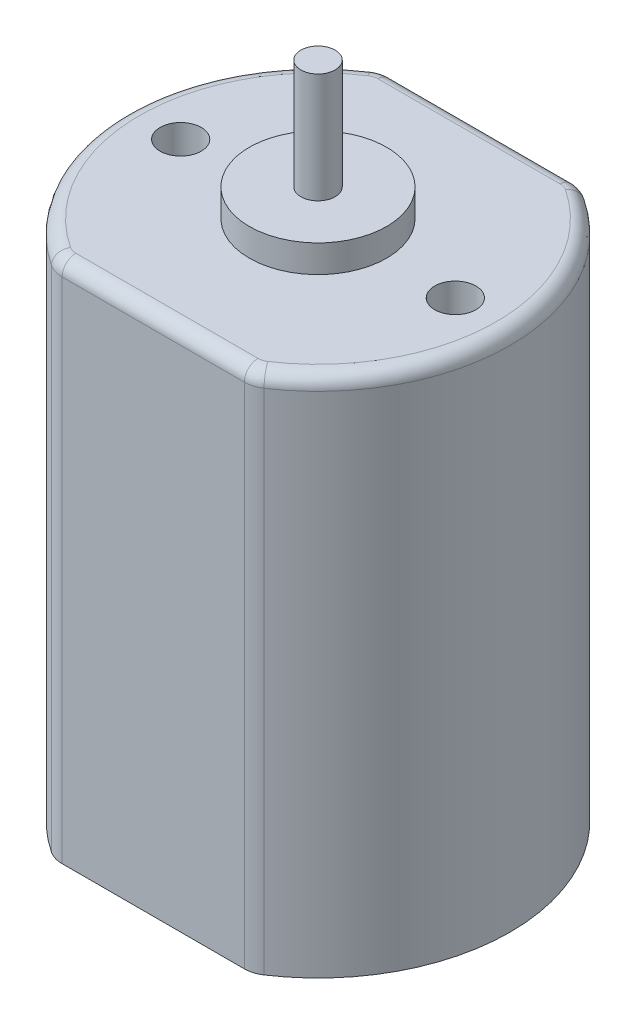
ISO-10303-21;
HEADER;
FILE_DESCRIPTION(('STEP AP214'),'2;1');
FILE_NAME('part.step','',(''),(''),'','','');
FILE_SCHEMA(('AUTOMOTIVE_DESIGN { 1 0 10303 214 1 1 1 1 }'));
ENDSEC;
DATA;
#1=APPLICATION_CONTEXT('core data for automotive mechanical design processes');
#2=APPLICATION_PROTOCOL_DEFINITION('international standard','automotive_design',2000,#1);
#3=PRODUCT_CONTEXT('',#1,'mechanical');
#4=PRODUCT('Part','Part','',(#3));
#5=PRODUCT_RELATED_PRODUCT_CATEGORY('part','',(#4));
#6=PRODUCT_DEFINITION_FORMATION('','',#4);
#7=PRODUCT_DEFINITION_CONTEXT('part definition',#1,'design');
#8=PRODUCT_DEFINITION('design','',#6,#7);
#9=PRODUCT_DEFINITION_SHAPE('','',#8);
#10=(LENGTH_UNIT() NAMED_UNIT(*) SI_UNIT(.MILLI.,.METRE.));
#11=(NAMED_UNIT(*) PLANE_ANGLE_UNIT() SI_UNIT($,.RADIAN.));
#12=(NAMED_UNIT(*) SI_UNIT($,.STERADIAN.) SOLID_ANGLE_UNIT());
#13=UNCERTAINTY_MEASURE_WITH_UNIT(LENGTH_MEASURE(1.E-05),#10,'distance_accuracy_value','');
#14=(GEOMETRIC_REPRESENTATION_CONTEXT(3) GLOBAL_UNCERTAINTY_ASSIGNED_CONTEXT((#13)) GLOBAL_UNIT_ASSIGNED_CONTEXT((#10,
#11,#12)) REPRESENTATION_CONTEXT('',''));
#15=CARTESIAN_POINT('',(0.,0.,0.));
#16=DIRECTION('',(0.,0.,1.));
#17=DIRECTION('',(1.,0.,0.));
#18=AXIS2_PLACEMENT_3D('',#15,#16,#17);
#19=CARTESIAN_POINT('',(0.,20.,0.));
#20=DIRECTION('',(0.,1.,0.));
#21=DIRECTION('',(0.,0.,1.));
#22=AXIS2_PLACEMENT_3D('',#19,#20,#21);
#23=PLANE('',#22);
#24=CARTESIAN_POINT('',(0.,20.,0.));
#25=DIRECTION('',(0.,1.,0.));
#26=DIRECTION('',(0.,0.,1.));
#27=AXIS2_PLACEMENT_3D('',#24,#25,#26);
#28=CIRCLE('',#27,2.5);
#29=CARTESIAN_POINT('',(0.,20.,2.5));
#30=VERTEX_POINT('',#29);
#31=EDGE_CURVE('E273',#30,#30,#28,.T.);
#32=ORIENTED_EDGE('',*,*,#31,.T.);
#33=EDGE_LOOP('',(#32));
#34=FACE_BOUND('',#33,.T.);
#35=CARTESIAN_POINT('',(0.,20.,0.));
#36=DIRECTION('',(0.,1.,0.));
#37=DIRECTION('',(0.,0.,1.));
#38=AXIS2_PLACEMENT_3D('',#35,#36,#37);
#39=CIRCLE('',#38,0.625);
#40=CARTESIAN_POINT('',(0.,20.,0.625));
#41=VERTEX_POINT('',#40);
#42=EDGE_CURVE('E282',#41,#41,#39,.T.);
#43=ORIENTED_EDGE('',*,*,#42,.F.);
#44=EDGE_LOOP('',(#43));
#45=FACE_BOUND('',#44,.T.);
#46=ADVANCED_FACE('F33',(#34,#45),#23,.T.);
#47=CARTESIAN_POINT('',(-3.3166247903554,19.,-5.));
#48=DIRECTION('',(0.,1.,0.));
#49=DIRECTION('',(0.,0.,1.));
#50=AXIS2_PLACEMENT_3D('',#47,#48,#49);
#51=PLANE('',#50);
#52=CARTESIAN_POINT('',(-5.,19.,0.));
#53=DIRECTION('',(0.,1.,0.));
#54=DIRECTION('',(0.,0.,1.));
#55=AXIS2_PLACEMENT_3D('',#52,#53,#54);
#56=CIRCLE('',#55,0.75);
#57=CARTESIAN_POINT('',(-5.,19.,0.75));
#58=VERTEX_POINT('',#57);
#59=EDGE_CURVE('E300',#58,#58,#56,.T.);
#60=ORIENTED_EDGE('',*,*,#59,.F.);
#61=EDGE_LOOP('',(#60));
#62=FACE_BOUND('',#61,.T.);
#63=CARTESIAN_POINT('',(-3.53553390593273,19.,-3.53553390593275));
#64=DIRECTION('',(0.,1.,0.));
#65=DIRECTION('',(0.,0.,1.));
#66=AXIS2_PLACEMENT_3D('',#63,#64,#65);
#67=CIRCLE('',#66,0.5);
#68=CARTESIAN_POINT('',(-3.53553390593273,19.,-3.03553390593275));
#69=VERTEX_POINT('',#68);
#70=EDGE_CURVE('E294',#69,#69,#67,.T.);
#71=ORIENTED_EDGE('',*,*,#70,.F.);
#72=EDGE_LOOP('',(#71));
#73=FACE_BOUND('',#72,.T.);
#74=CARTESIAN_POINT('',(5.,19.,0.));
#75=DIRECTION('',(0.,1.,0.));
#76=DIRECTION('',(0.,0.,1.));
#77=AXIS2_PLACEMENT_3D('',#74,#75,#76);
#78=CIRCLE('',#77,0.75);
#79=CARTESIAN_POINT('',(5.,19.,0.75));
#80=VERTEX_POINT('',#79);
#81=EDGE_CURVE('E288',#80,#80,#78,.T.);
#82=ORIENTED_EDGE('',*,*,#81,.F.);
#83=EDGE_LOOP('',(#82));
#84=FACE_BOUND('',#83,.T.);
#85=DIRECTION('',(1.,0.,0.));
#86=VECTOR('',#85,1.);
#87=CARTESIAN_POINT('',(3.3166247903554,19.,5.5));
#88=LINE('',#87,#86);
#89=CARTESIAN_POINT('',(-3.3166247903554,19.,5.5));
#90=VERTEX_POINT('',#89);
#91=CARTESIAN_POINT('',(3.3166247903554,19.,5.5));
#92=VERTEX_POINT('',#91);
#93=EDGE_CURVE('E191',#90,#92,#88,.T.);
#94=ORIENTED_EDGE('',*,*,#93,.T.);
#95=CARTESIAN_POINT('',(3.3166247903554,19.,5.));
#96=DIRECTION('',(0.,1.,0.));
#97=DIRECTION('',(0.,0.,1.));
#98=AXIS2_PLACEMENT_3D('',#95,#96,#97);
#99=CIRCLE('',#98,0.5);
#100=CARTESIAN_POINT('',(3.59301018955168,19.,5.41666666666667));
#101=VERTEX_POINT('',#100);
#102=EDGE_CURVE('E193',#92,#101,#99,.T.);
#103=ORIENTED_EDGE('',*,*,#102,.T.);
#104=CARTESIAN_POINT('',(0.,19.,0.));
#105=DIRECTION('',(0.,1.,0.));
#106=DIRECTION('',(0.,0.,1.));
#107=AXIS2_PLACEMENT_3D('',#104,#105,#106);
#108=CIRCLE('',#107,6.5);
#109=CARTESIAN_POINT('',(3.59301018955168,19.,-5.41666666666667));
#110=VERTEX_POINT('',#109);
#111=EDGE_CURVE('E132',#101,#110,#108,.T.);
#112=ORIENTED_EDGE('',*,*,#111,.T.);
#113=CARTESIAN_POINT('',(3.31662479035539,19.,-5.));
#114=DIRECTION('',(0.,1.,0.));
#115=DIRECTION('',(0.,0.,1.));
#116=AXIS2_PLACEMENT_3D('',#113,#114,#115);
#117=CIRCLE('',#116,0.5);
#118=CARTESIAN_POINT('',(3.31662479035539,19.,-5.5));
#119=VERTEX_POINT('',#118);
#120=EDGE_CURVE('E181',#110,#119,#117,.T.);
#121=ORIENTED_EDGE('',*,*,#120,.T.);
#122=DIRECTION('',(-1.,0.,0.));
#123=VECTOR('',#122,1.);
#124=CARTESIAN_POINT('',(-3.3166247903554,19.,-5.5));
#125=LINE('',#124,#123);
#126=CARTESIAN_POINT('',(-3.3166247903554,19.,-5.5));
#127=VERTEX_POINT('',#126);
#128=EDGE_CURVE('E183',#119,#127,#125,.T.);
#129=ORIENTED_EDGE('',*,*,#128,.T.);
#130=CARTESIAN_POINT('',(-3.3166247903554,19.,-5.));
#131=DIRECTION('',(0.,1.,0.));
#132=DIRECTION('',(0.,0.,1.));
#133=AXIS2_PLACEMENT_3D('',#130,#131,#132);
#134=CIRCLE('',#133,0.5);
#135=CARTESIAN_POINT('',(-3.59301018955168,19.,-5.41666666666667));
#136=VERTEX_POINT('',#135);
#137=EDGE_CURVE('E185',#127,#136,#134,.T.);
#138=ORIENTED_EDGE('',*,*,#137,.T.);
#139=CARTESIAN_POINT('',(0.,19.,0.));
#140=DIRECTION('',(0.,1.,0.));
#141=DIRECTION('',(0.,0.,1.));
#142=AXIS2_PLACEMENT_3D('',#139,#140,#141);
#143=CIRCLE('',#142,6.5);
#144=CARTESIAN_POINT('',(-3.59301018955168,19.,5.41666666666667));
#145=VERTEX_POINT('',#144);
#146=EDGE_CURVE('E187',#136,#145,#143,.T.);
#147=ORIENTED_EDGE('',*,*,#146,.T.);
#148=CARTESIAN_POINT('',(-3.3166247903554,19.,5.));
#149=DIRECTION('',(0.,1.,0.));
#150=DIRECTION('',(0.,0.,1.));
#151=AXIS2_PLACEMENT_3D('',#148,#149,#150);
#152=CIRCLE('',#151,0.5);
#153=EDGE_CURVE('E189',#145,#90,#152,.T.);
#154=ORIENTED_EDGE('',*,*,#153,.T.);
#155=EDGE_LOOP('',(#94,#103,#112,#121,#129,#138,#147,#154));
#156=FACE_BOUND('',#155,.T.);
#157=CARTESIAN_POINT('',(0.,19.,0.));
#158=DIRECTION('',(0.,1.,0.));
#159=DIRECTION('',(0.,0.,1.));
#160=AXIS2_PLACEMENT_3D('',#157,#158,#159);
#161=CIRCLE('',#160,2.5);
#162=CARTESIAN_POINT('',(0.,19.,2.5));
#163=VERTEX_POINT('',#162);
#164=EDGE_CURVE('E276',#163,#163,#161,.T.);
#165=ORIENTED_EDGE('',*,*,#164,.F.);
#166=EDGE_LOOP('',(#165));
#167=FACE_BOUND('',#166,.T.);
#168=ADVANCED_FACE('F306',(#62,#73,#84,#156,#167),#51,.T.);
#169=CARTESIAN_POINT('',(-3.3166247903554,19.,-5.));
#170=DIRECTION('',(0.,-1.,0.));
#171=DIRECTION('',(0.,0.,-1.));
#172=AXIS2_PLACEMENT_3D('',#169,#170,#171);
#173=CYLINDRICAL_SURFACE('',#172,1.);
#174=DIRECTION('',(0.,-1.,0.));
#175=VECTOR('',#174,1.);
#176=CARTESIAN_POINT('',(-3.86939558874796,19.,-5.83333333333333));
#177=LINE('',#176,#175);
#178=CARTESIAN_POINT('',(-3.86939558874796,18.5,-5.83333333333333));
#179=VERTEX_POINT('',#178);
#180=CARTESIAN_POINT('',(-3.86939558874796,0.,-5.83333333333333));
#181=VERTEX_POINT('',#180);
#182=EDGE_CURVE('E121',#179,#181,#177,.T.);
#183=ORIENTED_EDGE('',*,*,#182,.F.);
#184=CARTESIAN_POINT('',(-3.3166247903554,18.5,-5.));
#185=DIRECTION('',(0.,1.,0.));
#186=DIRECTION('',(0.,0.,1.));
#187=AXIS2_PLACEMENT_3D('',#184,#185,#186);
#188=CIRCLE('',#187,1.);
#189=CARTESIAN_POINT('',(-3.3166247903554,18.5,-6.));
#190=VERTEX_POINT('',#189);
#191=EDGE_CURVE('E204',#179,#190,#188,.F.);
#192=ORIENTED_EDGE('',*,*,#191,.T.);
#193=DIRECTION('',(0.,-1.,0.));
#194=VECTOR('',#193,1.);
#195=CARTESIAN_POINT('',(-3.3166247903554,19.,-6.));
#196=LINE('',#195,#194);
#197=CARTESIAN_POINT('',(-3.3166247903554,0.,-6.));
#198=VERTEX_POINT('',#197);
#199=EDGE_CURVE('E144',#190,#198,#196,.T.);
#200=ORIENTED_EDGE('',*,*,#199,.T.);
#201=CARTESIAN_POINT('',(-3.3166247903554,0.,-5.));
#202=DIRECTION('',(0.,1.,0.));
#203=DIRECTION('',(0.,0.,1.));
#204=AXIS2_PLACEMENT_3D('',#201,#202,#203);
#205=CIRCLE('',#204,1.);
#206=EDGE_CURVE('E139',#198,#181,#205,.T.);
#207=ORIENTED_EDGE('',*,*,#206,.T.);
#208=EDGE_LOOP('',(#183,#192,#200,#207));
#209=FACE_BOUND('',#208,.T.);
#210=ADVANCED_FACE('F35',(#209),#173,.T.);
#211=CARTESIAN_POINT('',(0.,19.,0.));
#212=DIRECTION('',(0.,-1.,0.));
#213=DIRECTION('',(0.,0.,-1.));
#214=AXIS2_PLACEMENT_3D('',#211,#212,#213);
#215=CYLINDRICAL_SURFACE('',#214,7.);
#216=DIRECTION('',(0.,-1.,0.));
#217=VECTOR('',#216,1.);
#218=CARTESIAN_POINT('',(-3.86939558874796,19.,5.83333333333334));
#219=LINE('',#218,#217);
#220=CARTESIAN_POINT('',(-3.86939558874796,18.5,5.83333333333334));
#221=VERTEX_POINT('',#220);
#222=CARTESIAN_POINT('',(-3.86939558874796,0.,5.83333333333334));
#223=VERTEX_POINT('',#222);
#224=EDGE_CURVE('E133',#221,#223,#219,.T.);
#225=ORIENTED_EDGE('',*,*,#224,.F.);
#226=CARTESIAN_POINT('',(0.,18.5,0.));
#227=DIRECTION('',(0.,1.,0.));
#228=DIRECTION('',(0.,0.,1.));
#229=AXIS2_PLACEMENT_3D('',#226,#227,#228);
#230=CIRCLE('',#229,7.);
#231=EDGE_CURVE('E128',#221,#179,#230,.F.);
#232=ORIENTED_EDGE('',*,*,#231,.T.);
#233=ORIENTED_EDGE('',*,*,#182,.T.);
#234=CARTESIAN_POINT('',(0.,0.,0.));
#235=DIRECTION('',(0.,1.,0.));
#236=DIRECTION('',(0.,0.,1.));
#237=AXIS2_PLACEMENT_3D('',#234,#235,#236);
#238=CIRCLE('',#237,7.);
#239=EDGE_CURVE('E125',#181,#223,#238,.T.);
#240=ORIENTED_EDGE('',*,*,#239,.T.);
#241=EDGE_LOOP('',(#225,#232,#233,#240));
#242=FACE_BOUND('',#241,.T.);
#243=ADVANCED_FACE('F124',(#242),#215,.T.);
#244=CARTESIAN_POINT('',(-3.3166247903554,19.,5.));
#245=DIRECTION('',(0.,-1.,0.));
#246=DIRECTION('',(0.,0.,-1.));
#247=AXIS2_PLACEMENT_3D('',#244,#245,#246);
#248=CYLINDRICAL_SURFACE('',#247,1.);
#249=DIRECTION('',(0.,-1.,0.));
#250=VECTOR('',#249,1.);
#251=CARTESIAN_POINT('',(-3.3166247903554,19.,6.));
#252=LINE('',#251,#250);
#253=CARTESIAN_POINT('',(-3.3166247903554,18.5,6.));
#254=VERTEX_POINT('',#253);
#255=CARTESIAN_POINT('',(-3.3166247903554,0.,6.));
#256=VERTEX_POINT('',#255);
#257=EDGE_CURVE('E177',#254,#256,#252,.T.);
#258=ORIENTED_EDGE('',*,*,#257,.F.);
#259=CARTESIAN_POINT('',(-3.3166247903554,18.5,5.));
#260=DIRECTION('',(0.,1.,0.));
#261=DIRECTION('',(0.,0.,1.));
#262=AXIS2_PLACEMENT_3D('',#259,#260,#261);
#263=CIRCLE('',#262,1.);
#264=EDGE_CURVE('E201',#254,#221,#263,.F.);
#265=ORIENTED_EDGE('',*,*,#264,.T.);
#266=ORIENTED_EDGE('',*,*,#224,.T.);
#267=CARTESIAN_POINT('',(-3.3166247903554,0.,5.));
#268=DIRECTION('',(0.,1.,0.));
#269=DIRECTION('',(0.,0.,-1.));
#270=AXIS2_PLACEMENT_3D('',#267,#268,#269);
#271=CIRCLE('',#270,1.);
#272=EDGE_CURVE('E142',#223,#256,#271,.T.);
#273=ORIENTED_EDGE('',*,*,#272,.T.);
#274=EDGE_LOOP('',(#258,#265,#266,#273));
#275=FACE_BOUND('',#274,.T.);
#276=ADVANCED_FACE('F261',(#275),#248,.T.);
#277=CARTESIAN_POINT('',(-3.3166247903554,19.,6.));
#278=DIRECTION('',(0.,0.,-1.));
#279=DIRECTION('',(-1.,0.,0.));
#280=AXIS2_PLACEMENT_3D('',#277,#278,#279);
#281=PLANE('',#280);
#282=DIRECTION('',(0.,-1.,0.));
#283=VECTOR('',#282,1.);
#284=CARTESIAN_POINT('',(3.3166247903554,19.,6.));
#285=LINE('',#284,#283);
#286=CARTESIAN_POINT('',(3.3166247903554,18.5,6.));
#287=VERTEX_POINT('',#286);
#288=CARTESIAN_POINT('',(3.3166247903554,0.,6.));
#289=VERTEX_POINT('',#288);
#290=EDGE_CURVE('E175',#287,#289,#285,.T.);
#291=ORIENTED_EDGE('',*,*,#290,.F.);
#292=DIRECTION('',(1.,0.,0.));
#293=VECTOR('',#292,1.);
#294=CARTESIAN_POINT('',(-3.3166247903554,18.5,6.));
#295=LINE('',#294,#293);
#296=EDGE_CURVE('E199',#287,#254,#295,.F.);
#297=ORIENTED_EDGE('',*,*,#296,.T.);
#298=ORIENTED_EDGE('',*,*,#257,.T.);
#299=DIRECTION('',(1.,0.,0.));
#300=VECTOR('',#299,1.);
#301=CARTESIAN_POINT('',(-3.3166247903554,0.,6.));
#302=LINE('',#301,#300);
#303=EDGE_CURVE('E154',#256,#289,#302,.T.);
#304=ORIENTED_EDGE('',*,*,#303,.T.);
#305=EDGE_LOOP('',(#291,#297,#298,#304));
#306=FACE_BOUND('',#305,.T.);
#307=ADVANCED_FACE('F258',(#306),#281,.F.);
#308=CARTESIAN_POINT('',(3.3166247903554,19.,5.));
#309=DIRECTION('',(0.,-1.,0.));
#310=DIRECTION('',(0.,0.,-1.));
#311=AXIS2_PLACEMENT_3D('',#308,#309,#310);
#312=CYLINDRICAL_SURFACE('',#311,1.);
#313=DIRECTION('',(0.,-1.,0.));
#314=VECTOR('',#313,1.);
#315=CARTESIAN_POINT('',(3.86939558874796,19.,5.83333333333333));
#316=LINE('',#315,#314);
#317=CARTESIAN_POINT('',(3.86939558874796,18.5,5.83333333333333));
#318=VERTEX_POINT('',#317);
#319=CARTESIAN_POINT('',(3.86939558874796,0.,5.83333333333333));
#320=VERTEX_POINT('',#319);
#321=EDGE_CURVE('E173',#318,#320,#316,.T.);
#322=ORIENTED_EDGE('',*,*,#321,.F.);
#323=CARTESIAN_POINT('',(3.3166247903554,18.5,5.));
#324=DIRECTION('',(0.,1.,0.));
#325=DIRECTION('',(0.,0.,1.));
#326=AXIS2_PLACEMENT_3D('',#323,#324,#325);
#327=CIRCLE('',#326,1.);
#328=EDGE_CURVE('E196',#318,#287,#327,.F.);
#329=ORIENTED_EDGE('',*,*,#328,.T.);
#330=ORIENTED_EDGE('',*,*,#290,.T.);
#331=CARTESIAN_POINT('',(3.3166247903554,0.,5.));
#332=DIRECTION('',(0.,1.,0.));
#333=DIRECTION('',(0.,0.,-1.));
#334=AXIS2_PLACEMENT_3D('',#331,#332,#333);
#335=CIRCLE('',#334,1.);
#336=EDGE_CURVE('E157',#289,#320,#335,.T.);
#337=ORIENTED_EDGE('',*,*,#336,.T.);
#338=EDGE_LOOP('',(#322,#329,#330,#337));
#339=FACE_BOUND('',#338,.T.);
#340=ADVANCED_FACE('F241',(#339),#312,.T.);
#341=CARTESIAN_POINT('',(0.,19.,0.));
#342=DIRECTION('',(0.,-1.,0.));
#343=DIRECTION('',(0.,0.,-1.));
#344=AXIS2_PLACEMENT_3D('',#341,#342,#343);
#345=CYLINDRICAL_SURFACE('',#344,7.);
#346=DIRECTION('',(0.,-1.,0.));
#347=VECTOR('',#346,1.);
#348=CARTESIAN_POINT('',(3.86939558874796,19.,-5.83333333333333));
#349=LINE('',#348,#347);
#350=CARTESIAN_POINT('',(3.86939558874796,18.5,-5.83333333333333));
#351=VERTEX_POINT('',#350);
#352=CARTESIAN_POINT('',(3.86939558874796,0.,-5.83333333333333));
#353=VERTEX_POINT('',#352);
#354=EDGE_CURVE('E171',#351,#353,#349,.T.);
#355=ORIENTED_EDGE('',*,*,#354,.F.);
#356=CARTESIAN_POINT('',(0.,18.5,0.));
#357=DIRECTION('',(0.,1.,0.));
#358=DIRECTION('',(0.,0.,1.));
#359=AXIS2_PLACEMENT_3D('',#356,#357,#358);
#360=CIRCLE('',#359,7.);
#361=EDGE_CURVE('E11',#351,#318,#360,.F.);
#362=ORIENTED_EDGE('',*,*,#361,.T.);
#363=ORIENTED_EDGE('',*,*,#321,.T.);
#364=CARTESIAN_POINT('',(0.,0.,0.));
#365=DIRECTION('',(0.,1.,0.));
#366=DIRECTION('',(0.,0.,1.));
#367=AXIS2_PLACEMENT_3D('',#364,#365,#366);
#368=CIRCLE('',#367,7.);
#369=EDGE_CURVE('E160',#320,#353,#368,.T.);
#370=ORIENTED_EDGE('',*,*,#369,.T.);
#371=EDGE_LOOP('',(#355,#362,#363,#370));
#372=FACE_BOUND('',#371,.T.);
#373=ADVANCED_FACE('F238',(#372),#345,.T.);
#374=CARTESIAN_POINT('',(3.31662479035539,19.,-5.));
#375=DIRECTION('',(0.,-1.,0.));
#376=DIRECTION('',(0.,0.,-1.));
#377=AXIS2_PLACEMENT_3D('',#374,#375,#376);
#378=CYLINDRICAL_SURFACE('',#377,1.);
#379=DIRECTION('',(0.,-1.,0.));
#380=VECTOR('',#379,1.);
#381=CARTESIAN_POINT('',(3.31662479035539,19.,-6.));
#382=LINE('',#381,#380);
#383=CARTESIAN_POINT('',(3.31662479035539,18.5,-6.));
#384=VERTEX_POINT('',#383);
#385=CARTESIAN_POINT('',(3.31662479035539,0.,-6.));
#386=VERTEX_POINT('',#385);
#387=EDGE_CURVE('E169',#384,#386,#382,.T.);
#388=ORIENTED_EDGE('',*,*,#387,.F.);
#389=CARTESIAN_POINT('',(3.31662479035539,18.5,-5.));
#390=DIRECTION('',(0.,1.,0.));
#391=DIRECTION('',(0.,0.,1.));
#392=AXIS2_PLACEMENT_3D('',#389,#390,#391);
#393=CIRCLE('',#392,1.);
#394=EDGE_CURVE('E41',#384,#351,#393,.F.);
#395=ORIENTED_EDGE('',*,*,#394,.T.);
#396=ORIENTED_EDGE('',*,*,#354,.T.);
#397=CARTESIAN_POINT('',(3.31662479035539,0.,-5.));
#398=DIRECTION('',(0.,1.,0.));
#399=DIRECTION('',(0.,0.,1.));
#400=AXIS2_PLACEMENT_3D('',#397,#398,#399);
#401=CIRCLE('',#400,1.);
#402=EDGE_CURVE('E163',#353,#386,#401,.T.);
#403=ORIENTED_EDGE('',*,*,#402,.T.);
#404=EDGE_LOOP('',(#388,#395,#396,#403));
#405=FACE_BOUND('',#404,.T.);
#406=ADVANCED_FACE('F478',(#405),#378,.T.);
#407=CARTESIAN_POINT('',(-3.3166247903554,19.,-6.));
#408=DIRECTION('',(0.,0.,1.));
#409=DIRECTION('',(1.,0.,0.));
#410=AXIS2_PLACEMENT_3D('',#407,#408,#409);
#411=PLANE('',#410);
#412=ORIENTED_EDGE('',*,*,#199,.F.);
#413=DIRECTION('',(-1.,0.,0.));
#414=VECTOR('',#413,1.);
#415=CARTESIAN_POINT('',(3.31662479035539,18.5,-6.));
#416=LINE('',#415,#414);
#417=EDGE_CURVE('E55',#190,#384,#416,.F.);
#418=ORIENTED_EDGE('',*,*,#417,.T.);
#419=ORIENTED_EDGE('',*,*,#387,.T.);
#420=DIRECTION('',(-1.,0.,0.));
#421=VECTOR('',#420,1.);
#422=CARTESIAN_POINT('',(-3.3166247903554,0.,-6.));
#423=LINE('',#422,#421);
#424=EDGE_CURVE('E166',#386,#198,#423,.T.);
#425=ORIENTED_EDGE('',*,*,#424,.T.);
#426=EDGE_LOOP('',(#412,#418,#419,#425));
#427=FACE_BOUND('',#426,.T.);
#428=ADVANCED_FACE('F209',(#427),#411,.F.);
#429=CARTESIAN_POINT('',(-3.3166247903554,0.,-5.));
#430=DIRECTION('',(0.,1.,0.));
#431=DIRECTION('',(0.,0.,1.));
#432=AXIS2_PLACEMENT_3D('',#429,#430,#431);
#433=PLANE('',#432);
#434=ORIENTED_EDGE('',*,*,#206,.F.);
#435=ORIENTED_EDGE('',*,*,#424,.F.);
#436=ORIENTED_EDGE('',*,*,#402,.F.);
#437=ORIENTED_EDGE('',*,*,#369,.F.);
#438=ORIENTED_EDGE('',*,*,#336,.F.);
#439=ORIENTED_EDGE('',*,*,#303,.F.);
#440=ORIENTED_EDGE('',*,*,#272,.F.);
#441=ORIENTED_EDGE('',*,*,#239,.F.);
#442=EDGE_LOOP('',(#434,#435,#436,#437,#438,#439,#440,#441));
#443=FACE_BOUND('',#442,.T.);
#444=ADVANCED_FACE('F137',(#443),#433,.F.);
#445=CARTESIAN_POINT('',(-3.3166247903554,18.5,-5.));
#446=DIRECTION('',(0.,1.,0.));
#447=DIRECTION('',(0.,0.,1.));
#448=AXIS2_PLACEMENT_3D('',#445,#446,#447);
#449=DEGENERATE_TOROIDAL_SURFACE('',#448,0.5,0.5,.T.);
#450=CARTESIAN_POINT('',(-3.3166247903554,18.5,-5.5));
#451=DIRECTION('',(1.,0.,0.));
#452=DIRECTION('',(0.,0.,-1.));
#453=AXIS2_PLACEMENT_3D('',#450,#451,#452);
#454=CIRCLE('',#453,0.5);
#455=EDGE_CURVE('E149',#190,#127,#454,.T.);
#456=ORIENTED_EDGE('',*,*,#455,.F.);
#457=ORIENTED_EDGE('',*,*,#191,.F.);
#458=CARTESIAN_POINT('',(-3.59301018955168,18.5,-5.41666666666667));
#459=DIRECTION('',(-0.833333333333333,0.,0.552770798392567));
#460=DIRECTION('',(0.552770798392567,0.,0.833333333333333));
#461=AXIS2_PLACEMENT_3D('',#458,#459,#460);
#462=CIRCLE('',#461,0.5);
#463=EDGE_CURVE('E146',#136,#179,#462,.T.);
#464=ORIENTED_EDGE('',*,*,#463,.F.);
#465=ORIENTED_EDGE('',*,*,#137,.F.);
#466=EDGE_LOOP('',(#456,#457,#464,#465));
#467=FACE_BOUND('',#466,.T.);
#468=ADVANCED_FACE('F212',(#467),#449,.T.);
#469=CARTESIAN_POINT('',(0.,18.5,0.));
#470=DIRECTION('',(0.,1.,0.));
#471=DIRECTION('',(0.,0.,1.));
#472=AXIS2_PLACEMENT_3D('',#469,#470,#471);
#473=TOROIDAL_SURFACE('',#472,6.5,0.5);
#474=ORIENTED_EDGE('',*,*,#463,.T.);
#475=ORIENTED_EDGE('',*,*,#231,.F.);
#476=CARTESIAN_POINT('',(-3.59301018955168,18.5,5.41666666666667));
#477=DIRECTION('',(0.833333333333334,0.,0.552770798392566));
#478=DIRECTION('',(0.552770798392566,0.,-0.833333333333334));
#479=AXIS2_PLACEMENT_3D('',#476,#477,#478);
#480=CIRCLE('',#479,0.5);
#481=EDGE_CURVE('E215',#145,#221,#480,.T.);
#482=ORIENTED_EDGE('',*,*,#481,.F.);
#483=ORIENTED_EDGE('',*,*,#146,.F.);
#484=EDGE_LOOP('',(#474,#475,#482,#483));
#485=FACE_BOUND('',#484,.T.);
#486=ADVANCED_FACE('F451',(#485),#473,.T.);
#487=CARTESIAN_POINT('',(-3.3166247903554,18.5,-5.5));
#488=DIRECTION('',(1.,0.,0.));
#489=DIRECTION('',(0.,0.,-1.));
#490=AXIS2_PLACEMENT_3D('',#487,#488,#489);
#491=CYLINDRICAL_SURFACE('',#490,0.5);
#492=ORIENTED_EDGE('',*,*,#455,.T.);
#493=ORIENTED_EDGE('',*,*,#128,.F.);
#494=CARTESIAN_POINT('',(3.31662479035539,18.5,-5.5));
#495=DIRECTION('',(1.,0.,0.));
#496=DIRECTION('',(0.,0.,-1.));
#497=AXIS2_PLACEMENT_3D('',#494,#495,#496);
#498=CIRCLE('',#497,0.5);
#499=EDGE_CURVE('E219',#384,#119,#498,.T.);
#500=ORIENTED_EDGE('',*,*,#499,.F.);
#501=ORIENTED_EDGE('',*,*,#417,.F.);
#502=EDGE_LOOP('',(#492,#493,#500,#501));
#503=FACE_BOUND('',#502,.T.);
#504=ADVANCED_FACE('F217',(#503),#491,.T.);
#505=CARTESIAN_POINT('',(-3.3166247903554,18.5,5.));
#506=DIRECTION('',(0.,1.,0.));
#507=DIRECTION('',(0.,0.,1.));
#508=AXIS2_PLACEMENT_3D('',#505,#506,#507);
#509=DEGENERATE_TOROIDAL_SURFACE('',#508,0.5,0.5,.T.);
#510=ORIENTED_EDGE('',*,*,#481,.T.);
#511=ORIENTED_EDGE('',*,*,#264,.F.);
#512=CARTESIAN_POINT('',(-3.3166247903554,18.5,5.5));
#513=DIRECTION('',(1.,0.,0.));
#514=DIRECTION('',(0.,0.,-1.));
#515=AXIS2_PLACEMENT_3D('',#512,#513,#514);
#516=CIRCLE('',#515,0.5);
#517=EDGE_CURVE('E222',#90,#254,#516,.T.);
#518=ORIENTED_EDGE('',*,*,#517,.F.);
#519=ORIENTED_EDGE('',*,*,#153,.F.);
#520=EDGE_LOOP('',(#510,#511,#518,#519));
#521=FACE_BOUND('',#520,.T.);
#522=ADVANCED_FACE('F264',(#521),#509,.T.);
#523=CARTESIAN_POINT('',(3.31662479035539,18.5,-5.));
#524=DIRECTION('',(0.,1.,0.));
#525=DIRECTION('',(0.,0.,1.));
#526=AXIS2_PLACEMENT_3D('',#523,#524,#525);
#527=DEGENERATE_TOROIDAL_SURFACE('',#526,0.5,0.5,.T.);
#528=ORIENTED_EDGE('',*,*,#499,.T.);
#529=ORIENTED_EDGE('',*,*,#120,.F.);
#530=CARTESIAN_POINT('',(3.59301018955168,18.5,-5.41666666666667));
#531=DIRECTION('',(0.833333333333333,0.,0.552770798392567));
#532=DIRECTION('',(0.552770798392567,0.,-0.833333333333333));
#533=AXIS2_PLACEMENT_3D('',#530,#531,#532);
#534=CIRCLE('',#533,0.5);
#535=EDGE_CURVE('E227',#351,#110,#534,.T.);
#536=ORIENTED_EDGE('',*,*,#535,.F.);
#537=ORIENTED_EDGE('',*,*,#394,.F.);
#538=EDGE_LOOP('',(#528,#529,#536,#537));
#539=FACE_BOUND('',#538,.T.);
#540=ADVANCED_FACE('F225',(#539),#527,.T.);
#541=CARTESIAN_POINT('',(-3.3166247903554,18.5,5.5));
#542=DIRECTION('',(-1.,0.,0.));
#543=DIRECTION('',(0.,0.,1.));
#544=AXIS2_PLACEMENT_3D('',#541,#542,#543);
#545=CYLINDRICAL_SURFACE('',#544,0.5);
#546=ORIENTED_EDGE('',*,*,#517,.T.);
#547=ORIENTED_EDGE('',*,*,#296,.F.);
#548=CARTESIAN_POINT('',(3.3166247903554,18.5,5.5));
#549=DIRECTION('',(1.,0.,0.));
#550=DIRECTION('',(0.,0.,-1.));
#551=AXIS2_PLACEMENT_3D('',#548,#549,#550);
#552=CIRCLE('',#551,0.5);
#553=EDGE_CURVE('E231',#92,#287,#552,.T.);
#554=ORIENTED_EDGE('',*,*,#553,.F.);
#555=ORIENTED_EDGE('',*,*,#93,.F.);
#556=EDGE_LOOP('',(#546,#547,#554,#555));
#557=FACE_BOUND('',#556,.T.);
#558=ADVANCED_FACE('F254',(#557),#545,.T.);
#559=CARTESIAN_POINT('',(0.,18.5,0.));
#560=DIRECTION('',(0.,1.,0.));
#561=DIRECTION('',(0.,0.,1.));
#562=AXIS2_PLACEMENT_3D('',#559,#560,#561);
#563=TOROIDAL_SURFACE('',#562,6.5,0.5);
#564=ORIENTED_EDGE('',*,*,#535,.T.);
#565=ORIENTED_EDGE('',*,*,#111,.F.);
#566=CARTESIAN_POINT('',(3.59301018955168,18.5,5.41666666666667));
#567=DIRECTION('',(-0.833333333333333,0.,0.552770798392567));
#568=DIRECTION('',(0.552770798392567,0.,0.833333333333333));
#569=AXIS2_PLACEMENT_3D('',#566,#567,#568);
#570=CIRCLE('',#569,0.5);
#571=EDGE_CURVE('E235',#318,#101,#570,.T.);
#572=ORIENTED_EDGE('',*,*,#571,.F.);
#573=ORIENTED_EDGE('',*,*,#361,.F.);
#574=EDGE_LOOP('',(#564,#565,#572,#573));
#575=FACE_BOUND('',#574,.T.);
#576=ADVANCED_FACE('F234',(#575),#563,.T.);
#577=CARTESIAN_POINT('',(3.3166247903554,18.5,5.));
#578=DIRECTION('',(0.,1.,0.));
#579=DIRECTION('',(0.,0.,1.));
#580=AXIS2_PLACEMENT_3D('',#577,#578,#579);
#581=DEGENERATE_TOROIDAL_SURFACE('',#580,0.5,0.5,.T.);
#582=ORIENTED_EDGE('',*,*,#553,.T.);
#583=ORIENTED_EDGE('',*,*,#328,.F.);
#584=ORIENTED_EDGE('',*,*,#571,.T.);
#585=ORIENTED_EDGE('',*,*,#102,.F.);
#586=EDGE_LOOP('',(#582,#583,#584,#585));
#587=FACE_BOUND('',#586,.T.);
#588=ADVANCED_FACE('F246',(#587),#581,.T.);
#589=CARTESIAN_POINT('',(0.,20.,0.));
#590=DIRECTION('',(0.,-1.,0.));
#591=DIRECTION('',(0.,0.,-1.));
#592=AXIS2_PLACEMENT_3D('',#589,#590,#591);
#593=CYLINDRICAL_SURFACE('',#592,2.5);
#594=ORIENTED_EDGE('',*,*,#31,.F.);
#595=EDGE_LOOP('',(#594));
#596=FACE_BOUND('',#595,.T.);
#597=ORIENTED_EDGE('',*,*,#164,.T.);
#598=EDGE_LOOP('',(#597));
#599=FACE_BOUND('',#598,.T.);
#600=ADVANCED_FACE('F317',(#596,#599),#593,.T.);
#601=CARTESIAN_POINT('',(0.,24.,0.));
#602=DIRECTION('',(0.,-1.,0.));
#603=DIRECTION('',(0.,0.,-1.));
#604=AXIS2_PLACEMENT_3D('',#601,#602,#603);
#605=CYLINDRICAL_SURFACE('',#604,0.625);
#606=CARTESIAN_POINT('',(0.,24.,0.));
#607=DIRECTION('',(0.,1.,0.));
#608=DIRECTION('',(0.,0.,1.));
#609=AXIS2_PLACEMENT_3D('',#606,#607,#608);
#610=CIRCLE('',#609,0.625);
#611=CARTESIAN_POINT('',(0.,24.,0.625));
#612=VERTEX_POINT('',#611);
#613=EDGE_CURVE('E279',#612,#612,#610,.T.);
#614=ORIENTED_EDGE('',*,*,#613,.F.);
#615=EDGE_LOOP('',(#614));
#616=FACE_BOUND('',#615,.T.);
#617=ORIENTED_EDGE('',*,*,#42,.T.);
#618=EDGE_LOOP('',(#617));
#619=FACE_BOUND('',#618,.T.);
#620=ADVANCED_FACE('F319',(#616,#619),#605,.T.);
#621=CARTESIAN_POINT('',(0.,24.,0.));
#622=DIRECTION('',(0.,1.,0.));
#623=DIRECTION('',(0.,0.,1.));
#624=AXIS2_PLACEMENT_3D('',#621,#622,#623);
#625=PLANE('',#624);
#626=ORIENTED_EDGE('',*,*,#613,.T.);
#627=EDGE_LOOP('',(#626));
#628=FACE_BOUND('',#627,.T.);
#629=ADVANCED_FACE('F326',(#628),#625,.T.);
#630=CARTESIAN_POINT('',(5.,17.,0.));
#631=DIRECTION('',(0.,1.,0.));
#632=DIRECTION('',(0.,0.,1.));
#633=AXIS2_PLACEMENT_3D('',#630,#631,#632);
#634=CYLINDRICAL_SURFACE('',#633,0.75);
#635=CARTESIAN_POINT('',(5.,17.,0.));
#636=DIRECTION('',(0.,1.,0.));
#637=DIRECTION('',(0.,0.,1.));
#638=AXIS2_PLACEMENT_3D('',#635,#636,#637);
#639=CIRCLE('',#638,0.75);
#640=CARTESIAN_POINT('',(5.,17.,0.75));
#641=VERTEX_POINT('',#640);
#642=EDGE_CURVE('E285',#641,#641,#639,.T.);
#643=ORIENTED_EDGE('',*,*,#642,.F.);
#644=EDGE_LOOP('',(#643));
#645=FACE_BOUND('',#644,.T.);
#646=ORIENTED_EDGE('',*,*,#81,.T.);
#647=EDGE_LOOP('',(#646));
#648=FACE_BOUND('',#647,.T.);
#649=ADVANCED_FACE('F340',(#645,#648),#634,.F.);
#650=CARTESIAN_POINT('',(5.,17.,0.));
#651=DIRECTION('',(0.,1.,0.));
#652=DIRECTION('',(0.,0.,1.));
#653=AXIS2_PLACEMENT_3D('',#650,#651,#652);
#654=PLANE('',#653);
#655=ORIENTED_EDGE('',*,*,#642,.T.);
#656=EDGE_LOOP('',(#655));
#657=FACE_BOUND('',#656,.T.);
#658=ADVANCED_FACE('F344',(#657),#654,.T.);
#659=CARTESIAN_POINT('',(-3.53553390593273,17.,-3.53553390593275));
#660=DIRECTION('',(0.,1.,0.));
#661=DIRECTION('',(0.,0.,1.));
#662=AXIS2_PLACEMENT_3D('',#659,#660,#661);
#663=CYLINDRICAL_SURFACE('',#662,0.5);
#664=CARTESIAN_POINT('',(-3.53553390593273,17.,-3.53553390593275));
#665=DIRECTION('',(0.,1.,0.));
#666=DIRECTION('',(0.,0.,1.));
#667=AXIS2_PLACEMENT_3D('',#664,#665,#666);
#668=CIRCLE('',#667,0.5);
#669=CARTESIAN_POINT('',(-3.53553390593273,17.,-3.03553390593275));
#670=VERTEX_POINT('',#669);
#671=EDGE_CURVE('E291',#670,#670,#668,.T.);
#672=ORIENTED_EDGE('',*,*,#671,.F.);
#673=EDGE_LOOP('',(#672));
#674=FACE_BOUND('',#673,.T.);
#675=ORIENTED_EDGE('',*,*,#70,.T.);
#676=EDGE_LOOP('',(#675));
#677=FACE_BOUND('',#676,.T.);
#678=ADVANCED_FACE('F348',(#674,#677),#663,.F.);
#679=CARTESIAN_POINT('',(-3.53553390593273,17.,-3.53553390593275));
#680=DIRECTION('',(0.,1.,0.));
#681=DIRECTION('',(0.,0.,1.));
#682=AXIS2_PLACEMENT_3D('',#679,#680,#681);
#683=PLANE('',#682);
#684=ORIENTED_EDGE('',*,*,#671,.T.);
#685=EDGE_LOOP('',(#684));
#686=FACE_BOUND('',#685,.T.);
#687=ADVANCED_FACE('F352',(#686),#683,.T.);
#688=CARTESIAN_POINT('',(-5.,17.,0.));
#689=DIRECTION('',(0.,1.,0.));
#690=DIRECTION('',(0.,0.,1.));
#691=AXIS2_PLACEMENT_3D('',#688,#689,#690);
#692=CYLINDRICAL_SURFACE('',#691,0.75);
#693=CARTESIAN_POINT('',(-5.,17.,0.));
#694=DIRECTION('',(0.,1.,0.));
#695=DIRECTION('',(0.,0.,1.));
#696=AXIS2_PLACEMENT_3D('',#693,#694,#695);
#697=CIRCLE('',#696,0.75);
#698=CARTESIAN_POINT('',(-5.,17.,0.75));
#699=VERTEX_POINT('',#698);
#700=EDGE_CURVE('E297',#699,#699,#697,.T.);
#701=ORIENTED_EDGE('',*,*,#700,.F.);
#702=EDGE_LOOP('',(#701));
#703=FACE_BOUND('',#702,.T.);
#704=ORIENTED_EDGE('',*,*,#59,.T.);
#705=EDGE_LOOP('',(#704));
#706=FACE_BOUND('',#705,.T.);
#707=ADVANCED_FACE('F304',(#703,#706),#692,.F.);
#708=CARTESIAN_POINT('',(-5.,17.,0.));
#709=DIRECTION('',(0.,1.,0.));
#710=DIRECTION('',(0.,0.,1.));
#711=AXIS2_PLACEMENT_3D('',#708,#709,#710);
#712=PLANE('',#711);
#713=ORIENTED_EDGE('',*,*,#700,.T.);
#714=EDGE_LOOP('',(#713));
#715=FACE_BOUND('',#714,.T.);
#716=ADVANCED_FACE('F359',(#715),#712,.T.);
#717=CLOSED_SHELL('',(#46,#168,#210,#243,#276,#307,#340,#373,#406,#428,#444,#468,#486,#504,#522,
#540,#558,#576,#588,#600,#620,#629,#649,#658,#678,#687,#707,#716));
#718=MANIFOLD_SOLID_BREP('B2',#717);
#719=ADVANCED_BREP_SHAPE_REPRESENTATION('',(#18,#718),#14);
#720=SHAPE_DEFINITION_REPRESENTATION(#9,#719);
ENDSEC;
END-ISO-10303-21;
